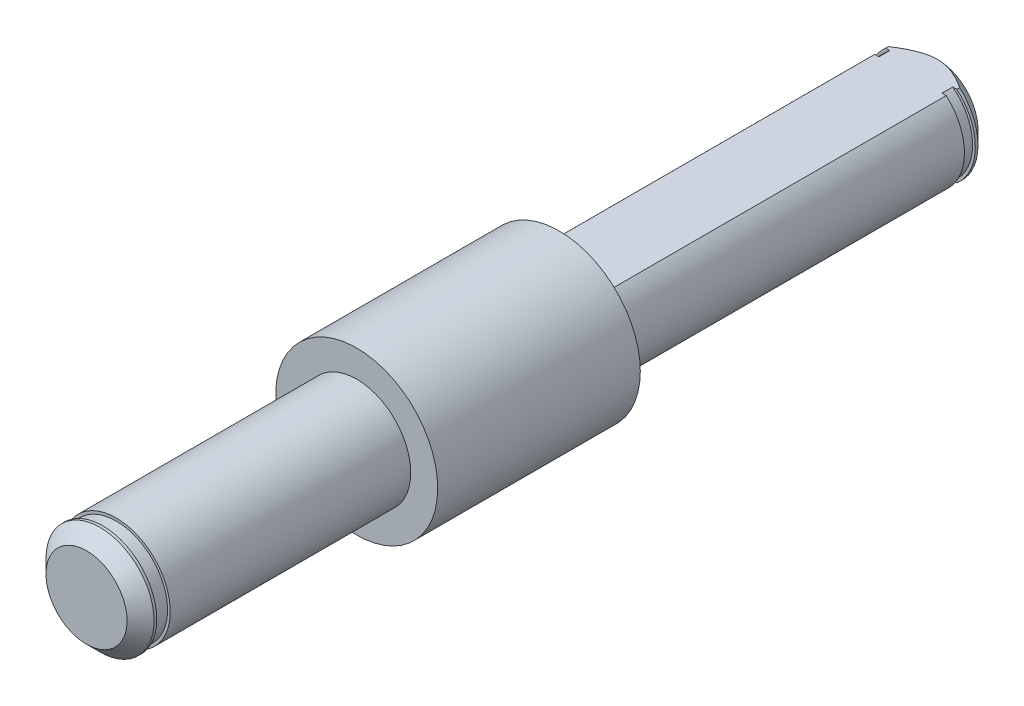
from build123d import *

# Parameters (mm, degrees)
ESQUISSE1_R             = 3
EXTRUSION1_DEPTH        = 7.5
ESQUISSE2_R             = 2
EXTRUSION2_DEPTH        = 10
CHANFREIN1_SIZE         = 0.5
ESQUISSE3_W             = 0.5
ESQUISSE3_H             = 0.537540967
EXTRUSION4_START        = 14
ESQUISSE9_R             = 2
EXTRUSION4_DEPTH        = 14
CHANFREIN4_SIZE         = 0.5
ESQUISSE10_OUTSIDE_W    = 14.524
ESQUISSE10_OUTSIDE_H    = 14.524
ESQUISSE10_OUTSIDE_W_2  = 4.59234609
ESQUISSE10_OUTSIDE_H_2  = 3
ENL_V_MAT_EXTRU_3_DEPTH = 14
ESQUISSE12_W            = 0.4
ESQUISSE12_H            = 0.201821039


with BuildPart() as part:
    # Esquisse1 → Extrusion1 (new body)
    with BuildSketch(Plane.XY):
        Circle(ESQUISSE1_R)
    extrude(amount=EXTRUSION1_DEPTH)

    # Esquisse2 → Extrusion2 (add)
    with BuildSketch(Plane.XY.offset(7.5)):
        Circle(ESQUISSE2_R)
    extrude(amount=EXTRUSION2_DEPTH)

    # Chanfrein1
    chanfrein1_edges = [part.edges().sort_by_distance(p)[0] for p in [
        (-2, 0, 17.5),
    ]]
    chamfer(chanfrein1_edges, length=CHANFREIN1_SIZE)

    # Esquisse3 → Enl_vement de mati_re-R_volution1 (revolve, cut)
    with BuildSketch(Plane(origin=(0, 0, 0), x_dir=(0, 0, -1), z_dir=(1, 0, 0)), mode=Mode.PRIVATE) as enl_vement_de_mati_re_r_volution1_sk:
        with Locations((-16.65, 2.168770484)):
            Rectangle(ESQUISSE3_W, ESQUISSE3_H)
    revolve(enl_vement_de_mati_re_r_volution1_sk.sketch.rotate(Axis((0, 0, 0), (0, 0, 1)), 90), axis=Axis((0, 0, 0), (0, 0, 1)), mode=Mode.SUBTRACT)

    # Esquisse9 → Extrusion4 (add)
    with BuildSketch(Plane(origin=(0, 0, 0), x_dir=(-1, 0, 0), z_dir=(0, 0, -1)).offset(EXTRUSION4_START)):
        Circle(ESQUISSE9_R)
    extrude(amount=-EXTRUSION4_DEPTH)

    # Chanfrein4
    chanfrein4_edges = [part.edges().sort_by_distance(p)[0] for p in [
        (2, 0, -14),
    ]]
    chamfer(chanfrein4_edges, length=CHANFREIN4_SIZE)

    # Esquisse10 outside → Enl_v. mat.-Extru.3 (cut)
    with BuildSketch(Plane(origin=(0, 0, -14), x_dir=(-1, 0, 0), z_dir=(0, 0, -1))):
        Rectangle(ESQUISSE10_OUTSIDE_W, ESQUISSE10_OUTSIDE_H)
        with Locations((-0.022185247, 0)):
            Rectangle(ESQUISSE10_OUTSIDE_W_2, ESQUISSE10_OUTSIDE_H_2, mode=Mode.SUBTRACT)
    extrude(amount=-ENL_V_MAT_EXTRU_3_DEPTH, mode=Mode.SUBTRACT)

    # Esquisse12 → Enl_vement de mati_re-R_volution4 (revolve, cut)
    with BuildSketch(Plane(origin=(0, 0, 0), x_dir=(0, 0, -1), z_dir=(1, 0, 0)), mode=Mode.PRIVATE) as enl_vement_de_mati_re_r_volution4_sk:
        with Locations((13.2, 2.00091052)):
            Rectangle(ESQUISSE12_W, ESQUISSE12_H)
    revolve(enl_vement_de_mati_re_r_volution4_sk.sketch.rotate(Axis((0, 0, 0), (0, 0, -1)), 270), axis=Axis((0, 0, 0), (0, 0, -1)), mode=Mode.SUBTRACT)


solid = part.part
